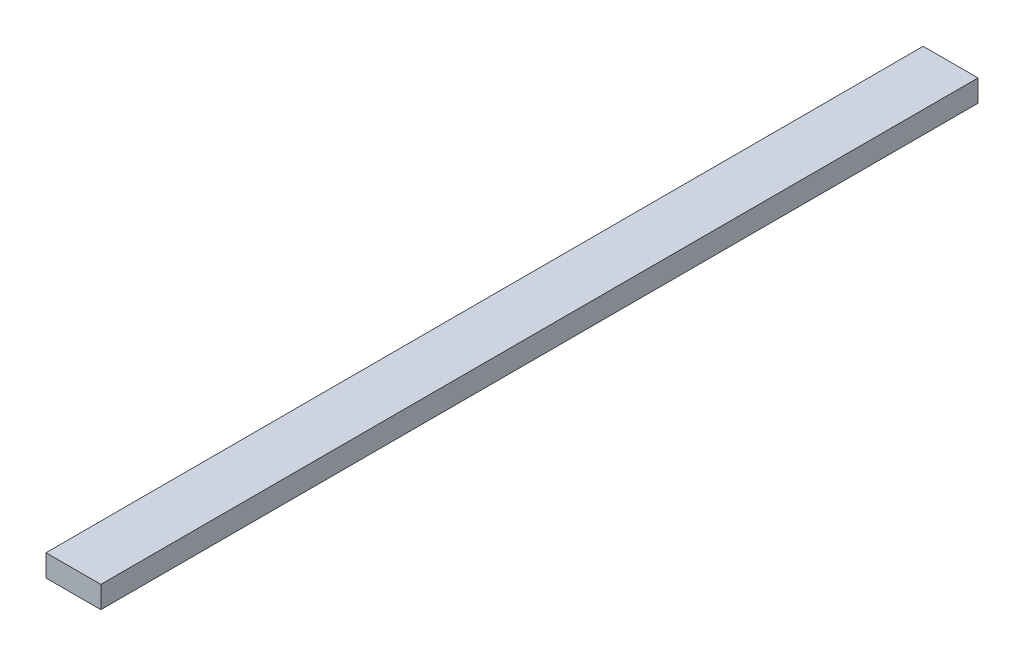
from build123d import *

# Parameters (mm, degrees)
ESQUISSE1_W      = 5
ESQUISSE1_H      = 2
EXTRUSION1_DEPTH = 80


with BuildPart() as part:
    # Esquisse1 → Extrusion1 (new body)
    with BuildSketch(Plane.XY):
        with Locations((2.5, 1)):
            Rectangle(ESQUISSE1_W, ESQUISSE1_H)
    extrude(amount=EXTRUSION1_DEPTH)


solid = part.part
